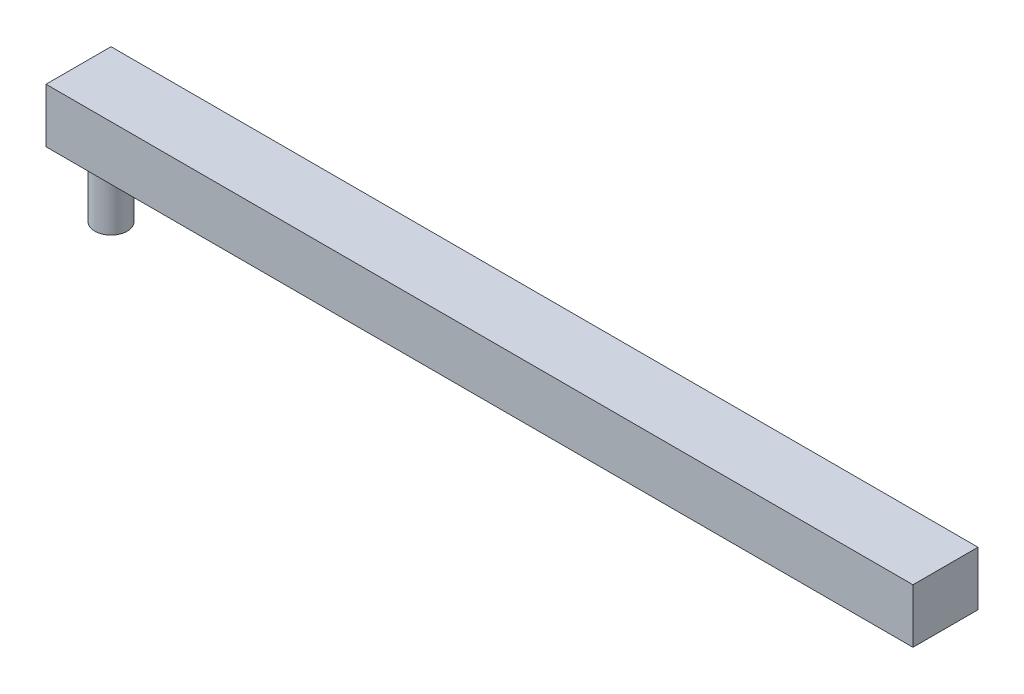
ISO-10303-21;
HEADER;
FILE_DESCRIPTION(('STEP AP214'),'2;1');
FILE_NAME('part.step','',(''),(''),'','','');
FILE_SCHEMA(('AUTOMOTIVE_DESIGN { 1 0 10303 214 1 1 1 1 }'));
ENDSEC;
DATA;
#1=APPLICATION_CONTEXT('core data for automotive mechanical design processes');
#2=APPLICATION_PROTOCOL_DEFINITION('international standard','automotive_design',2000,#1);
#3=PRODUCT_CONTEXT('',#1,'mechanical');
#4=PRODUCT('Part','Part','',(#3));
#5=PRODUCT_RELATED_PRODUCT_CATEGORY('part','',(#4));
#6=PRODUCT_DEFINITION_FORMATION('','',#4);
#7=PRODUCT_DEFINITION_CONTEXT('part definition',#1,'design');
#8=PRODUCT_DEFINITION('design','',#6,#7);
#9=PRODUCT_DEFINITION_SHAPE('','',#8);
#10=(LENGTH_UNIT() NAMED_UNIT(*) SI_UNIT(.MILLI.,.METRE.));
#11=(NAMED_UNIT(*) PLANE_ANGLE_UNIT() SI_UNIT($,.RADIAN.));
#12=(NAMED_UNIT(*) SI_UNIT($,.STERADIAN.) SOLID_ANGLE_UNIT());
#13=UNCERTAINTY_MEASURE_WITH_UNIT(LENGTH_MEASURE(1.E-05),#10,'distance_accuracy_value','');
#14=(GEOMETRIC_REPRESENTATION_CONTEXT(3) GLOBAL_UNCERTAINTY_ASSIGNED_CONTEXT((#13)) GLOBAL_UNIT_ASSIGNED_CONTEXT((#10,
#11,#12)) REPRESENTATION_CONTEXT('',''));
#15=CARTESIAN_POINT('',(0.,0.,0.));
#16=DIRECTION('',(0.,0.,1.));
#17=DIRECTION('',(1.,0.,0.));
#18=AXIS2_PLACEMENT_3D('',#15,#16,#17);
#19=CARTESIAN_POINT('',(72.1794202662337,-1.,-6.00000000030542));
#20=DIRECTION('',(-1.,0.,0.));
#21=DIRECTION('',(0.,0.,1.));
#22=AXIS2_PLACEMENT_3D('',#19,#20,#21);
#23=PLANE('',#22);
#24=DIRECTION('',(0.,0.,-1.));
#25=VECTOR('',#24,1.);
#26=CARTESIAN_POINT('',(72.1794202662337,-6.,-6.00000000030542));
#27=LINE('',#26,#25);
#28=CARTESIAN_POINT('',(72.1794202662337,-6.,-3.0542667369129E-10));
#29=VERTEX_POINT('',#28);
#30=CARTESIAN_POINT('',(72.1794202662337,-6.,-6.00000000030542));
#31=VERTEX_POINT('',#30);
#32=EDGE_CURVE('E109',#29,#31,#27,.T.);
#33=ORIENTED_EDGE('',*,*,#32,.T.);
#34=DIRECTION('',(0.,-1.,0.));
#35=VECTOR('',#34,1.);
#36=CARTESIAN_POINT('',(72.1794202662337,-1.,-6.00000000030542));
#37=LINE('',#36,#35);
#38=CARTESIAN_POINT('',(72.1794202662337,-1.,-6.00000000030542));
#39=VERTEX_POINT('',#38);
#40=EDGE_CURVE('E13',#39,#31,#37,.T.);
#41=ORIENTED_EDGE('',*,*,#40,.F.);
#42=DIRECTION('',(0.,0.,-1.));
#43=VECTOR('',#42,1.);
#44=CARTESIAN_POINT('',(72.1794202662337,-1.,-6.00000000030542));
#45=LINE('',#44,#43);
#46=CARTESIAN_POINT('',(72.1794202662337,-1.,-3.0542667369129E-10));
#47=VERTEX_POINT('',#46);
#48=EDGE_CURVE('E95',#47,#39,#45,.T.);
#49=ORIENTED_EDGE('',*,*,#48,.F.);
#50=DIRECTION('',(0.,-1.,0.));
#51=VECTOR('',#50,1.);
#52=CARTESIAN_POINT('',(72.1794202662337,-1.,-3.0542667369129E-10));
#53=LINE('',#52,#51);
#54=EDGE_CURVE('E105',#47,#29,#53,.T.);
#55=ORIENTED_EDGE('',*,*,#54,.T.);
#56=EDGE_LOOP('',(#33,#41,#49,#55));
#57=FACE_BOUND('',#56,.T.);
#58=ADVANCED_FACE('F45',(#57),#23,.F.);
#59=CARTESIAN_POINT('',(-7.82057973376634,-1.,-6.00000000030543));
#60=DIRECTION('',(0.,0.,1.));
#61=DIRECTION('',(1.,0.,0.));
#62=AXIS2_PLACEMENT_3D('',#59,#60,#61);
#63=PLANE('',#62);
#64=DIRECTION('',(-1.,0.,0.));
#65=VECTOR('',#64,1.);
#66=CARTESIAN_POINT('',(-7.82057973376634,-6.,-6.00000000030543));
#67=LINE('',#66,#65);
#68=CARTESIAN_POINT('',(-7.82057973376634,-6.,-6.00000000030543));
#69=VERTEX_POINT('',#68);
#70=EDGE_CURVE('E100',#31,#69,#67,.T.);
#71=ORIENTED_EDGE('',*,*,#70,.T.);
#72=DIRECTION('',(0.,-1.,0.));
#73=VECTOR('',#72,1.);
#74=CARTESIAN_POINT('',(-7.82057973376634,-1.,-6.00000000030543));
#75=LINE('',#74,#73);
#76=CARTESIAN_POINT('',(-7.82057973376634,-1.,-6.00000000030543));
#77=VERTEX_POINT('',#76);
#78=EDGE_CURVE('E53',#77,#69,#75,.T.);
#79=ORIENTED_EDGE('',*,*,#78,.F.);
#80=DIRECTION('',(-1.,0.,0.));
#81=VECTOR('',#80,1.);
#82=CARTESIAN_POINT('',(-7.82057973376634,-1.,-6.00000000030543));
#83=LINE('',#82,#81);
#84=EDGE_CURVE('E89',#39,#77,#83,.T.);
#85=ORIENTED_EDGE('',*,*,#84,.F.);
#86=ORIENTED_EDGE('',*,*,#40,.T.);
#87=EDGE_LOOP('',(#71,#79,#85,#86));
#88=FACE_BOUND('',#87,.T.);
#89=ADVANCED_FACE('F99',(#88),#63,.F.);
#90=CARTESIAN_POINT('',(-7.82057973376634,-1.,-3.05425823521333E-10));
#91=DIRECTION('',(1.,0.,0.));
#92=DIRECTION('',(0.,0.,-1.));
#93=AXIS2_PLACEMENT_3D('',#90,#91,#92);
#94=PLANE('',#93);
#95=DIRECTION('',(0.,0.,1.));
#96=VECTOR('',#95,1.);
#97=CARTESIAN_POINT('',(-7.82057973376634,-6.,-3.05425823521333E-10));
#98=LINE('',#97,#96);
#99=CARTESIAN_POINT('',(-7.82057973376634,-6.,-3.05425823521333E-10));
#100=VERTEX_POINT('',#99);
#101=EDGE_CURVE('E114',#69,#100,#98,.T.);
#102=ORIENTED_EDGE('',*,*,#101,.T.);
#103=DIRECTION('',(0.,-1.,0.));
#104=VECTOR('',#103,1.);
#105=CARTESIAN_POINT('',(-7.82057973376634,-1.,-3.05425823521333E-10));
#106=LINE('',#105,#104);
#107=CARTESIAN_POINT('',(-7.82057973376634,-1.,-3.05425823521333E-10));
#108=VERTEX_POINT('',#107);
#109=EDGE_CURVE('E102',#108,#100,#106,.T.);
#110=ORIENTED_EDGE('',*,*,#109,.F.);
#111=DIRECTION('',(0.,0.,1.));
#112=VECTOR('',#111,1.);
#113=CARTESIAN_POINT('',(-7.82057973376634,-1.,-3.05425823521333E-10));
#114=LINE('',#113,#112);
#115=EDGE_CURVE('E92',#77,#108,#114,.T.);
#116=ORIENTED_EDGE('',*,*,#115,.F.);
#117=ORIENTED_EDGE('',*,*,#78,.T.);
#118=EDGE_LOOP('',(#102,#110,#116,#117));
#119=FACE_BOUND('',#118,.T.);
#120=ADVANCED_FACE('F103',(#119),#94,.F.);
#121=CARTESIAN_POINT('',(72.1794202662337,-1.,-3.0542667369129E-10));
#122=DIRECTION('',(0.,0.,-1.));
#123=DIRECTION('',(-1.,0.,0.));
#124=AXIS2_PLACEMENT_3D('',#121,#122,#123);
#125=PLANE('',#124);
#126=DIRECTION('',(1.,0.,0.));
#127=VECTOR('',#126,1.);
#128=CARTESIAN_POINT('',(72.1794202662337,-6.,-3.0542667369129E-10));
#129=LINE('',#128,#127);
#130=EDGE_CURVE('E78',#100,#29,#129,.T.);
#131=ORIENTED_EDGE('',*,*,#130,.T.);
#132=ORIENTED_EDGE('',*,*,#54,.F.);
#133=DIRECTION('',(1.,0.,0.));
#134=VECTOR('',#133,1.);
#135=CARTESIAN_POINT('',(-2.82057973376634,-1.,-3.05426287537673E-10));
#136=LINE('',#135,#134);
#137=EDGE_CURVE('E61',#108,#47,#136,.T.);
#138=ORIENTED_EDGE('',*,*,#137,.F.);
#139=ORIENTED_EDGE('',*,*,#109,.T.);
#140=EDGE_LOOP('',(#131,#132,#138,#139));
#141=FACE_BOUND('',#140,.T.);
#142=ADVANCED_FACE('F118',(#141),#125,.F.);
#143=CARTESIAN_POINT('',(0.,-1.,0.));
#144=DIRECTION('',(0.,-1.,0.));
#145=DIRECTION('',(0.,0.,-1.));
#146=AXIS2_PLACEMENT_3D('',#143,#144,#145);
#147=PLANE('',#146);
#148=ORIENTED_EDGE('',*,*,#48,.T.);
#149=ORIENTED_EDGE('',*,*,#84,.T.);
#150=ORIENTED_EDGE('',*,*,#115,.T.);
#151=ORIENTED_EDGE('',*,*,#137,.T.);
#152=EDGE_LOOP('',(#148,#149,#150,#151));
#153=FACE_BOUND('',#152,.T.);
#154=ADVANCED_FACE('F90',(#153),#147,.F.);
#155=CARTESIAN_POINT('',(0.,-6.,0.));
#156=DIRECTION('',(0.,-1.,0.));
#157=DIRECTION('',(0.,0.,-1.));
#158=AXIS2_PLACEMENT_3D('',#155,#156,#157);
#159=PLANE('',#158);
#160=CARTESIAN_POINT('',(-4.82057973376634,-6.,-3.00000000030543));
#161=DIRECTION('',(0.,-1.,0.));
#162=DIRECTION('',(0.,0.,-1.));
#163=AXIS2_PLACEMENT_3D('',#160,#161,#162);
#164=CIRCLE('',#163,1.50000000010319);
#165=CARTESIAN_POINT('',(-4.82057973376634,-6.,-4.50000000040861));
#166=VERTEX_POINT('',#165);
#167=EDGE_CURVE('E123',#166,#166,#164,.T.);
#168=ORIENTED_EDGE('',*,*,#167,.F.);
#169=EDGE_LOOP('',(#168));
#170=FACE_BOUND('',#169,.T.);
#171=ORIENTED_EDGE('',*,*,#32,.F.);
#172=ORIENTED_EDGE('',*,*,#130,.F.);
#173=ORIENTED_EDGE('',*,*,#101,.F.);
#174=ORIENTED_EDGE('',*,*,#70,.F.);
#175=EDGE_LOOP('',(#171,#172,#173,#174));
#176=FACE_BOUND('',#175,.T.);
#177=ADVANCED_FACE('F130',(#170,#176),#159,.T.);
#178=CARTESIAN_POINT('',(-4.82057973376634,-16.2426406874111,-3.00000000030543));
#179=DIRECTION('',(0.,1.,0.));
#180=DIRECTION('',(0.,0.,1.));
#181=AXIS2_PLACEMENT_3D('',#178,#179,#180);
#182=CYLINDRICAL_SURFACE('',#181,1.50000000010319);
#183=ORIENTED_EDGE('',*,*,#167,.T.);
#184=EDGE_LOOP('',(#183));
#185=FACE_BOUND('',#184,.T.);
#186=CARTESIAN_POINT('',(-4.82057973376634,-12.,-3.00000000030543));
#187=DIRECTION('',(0.,-1.,0.));
#188=DIRECTION('',(0.,0.,-1.));
#189=AXIS2_PLACEMENT_3D('',#186,#187,#188);
#190=CIRCLE('',#189,1.50000000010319);
#191=CARTESIAN_POINT('',(-4.82057973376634,-12.,-4.50000000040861));
#192=VERTEX_POINT('',#191);
#193=EDGE_CURVE('E112',#192,#192,#190,.T.);
#194=ORIENTED_EDGE('',*,*,#193,.F.);
#195=EDGE_LOOP('',(#194));
#196=FACE_BOUND('',#195,.T.);
#197=ADVANCED_FACE('F127',(#185,#196),#182,.T.);
#198=CARTESIAN_POINT('',(-2.82057973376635,-12.,87.2879615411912));
#199=DIRECTION('',(0.,-1.,0.));
#200=DIRECTION('',(0.106726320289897,0.,-0.994288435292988));
#201=AXIS2_PLACEMENT_3D('',#198,#199,#200);
#202=PLANE('',#201);
#203=ORIENTED_EDGE('',*,*,#193,.T.);
#204=EDGE_LOOP('',(#203));
#205=FACE_BOUND('',#204,.T.);
#206=ADVANCED_FACE('F137',(#205),#202,.T.);
#207=CLOSED_SHELL('',(#58,#89,#120,#142,#154,#177,#197,#206));
#208=MANIFOLD_SOLID_BREP('B2',#207);
#209=ADVANCED_BREP_SHAPE_REPRESENTATION('',(#18,#208),#14);
#210=SHAPE_DEFINITION_REPRESENTATION(#9,#209);
ENDSEC;
END-ISO-10303-21;
